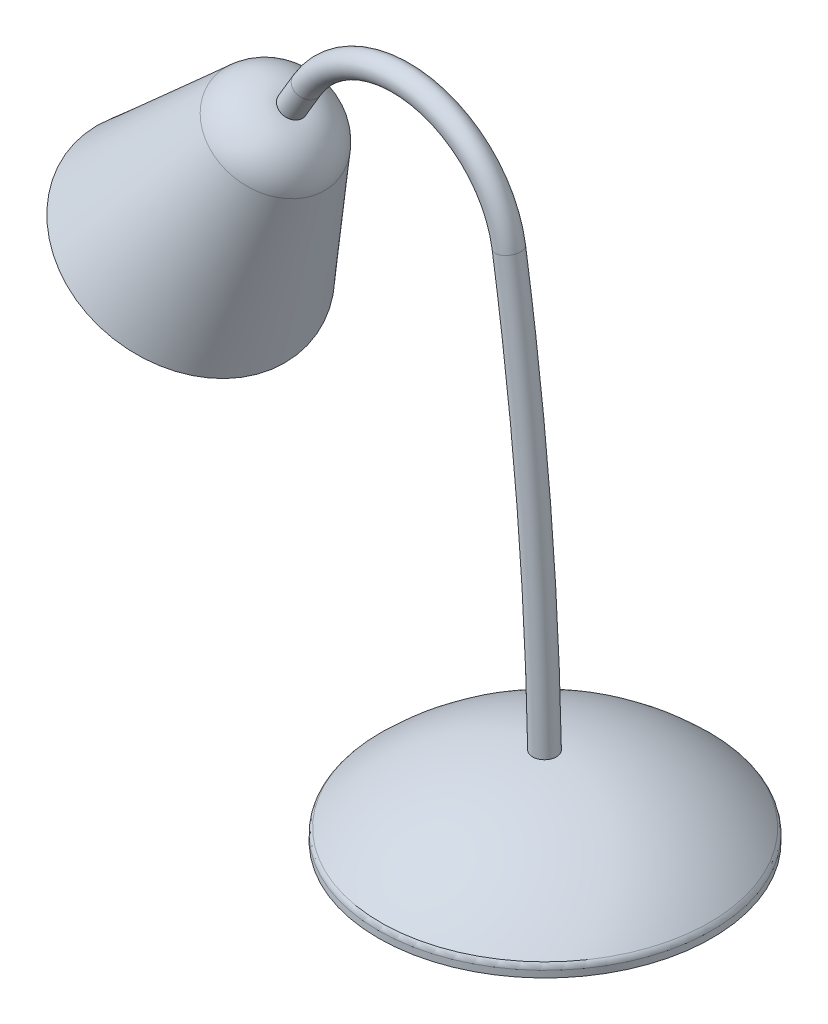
ISO-10303-21;
HEADER;
FILE_DESCRIPTION(('STEP AP214'),'2;1');
FILE_NAME('part.step','',(''),(''),'','','');
FILE_SCHEMA(('AUTOMOTIVE_DESIGN { 1 0 10303 214 1 1 1 1 }'));
ENDSEC;
DATA;
#1=APPLICATION_CONTEXT('core data for automotive mechanical design processes');
#2=APPLICATION_PROTOCOL_DEFINITION('international standard','automotive_design',2000,#1);
#3=PRODUCT_CONTEXT('',#1,'mechanical');
#4=PRODUCT('Part','Part','',(#3));
#5=PRODUCT_RELATED_PRODUCT_CATEGORY('part','',(#4));
#6=PRODUCT_DEFINITION_FORMATION('','',#4);
#7=PRODUCT_DEFINITION_CONTEXT('part definition',#1,'design');
#8=PRODUCT_DEFINITION('design','',#6,#7);
#9=PRODUCT_DEFINITION_SHAPE('','',#8);
#10=(LENGTH_UNIT() NAMED_UNIT(*) SI_UNIT(.MILLI.,.METRE.));
#11=(NAMED_UNIT(*) PLANE_ANGLE_UNIT() SI_UNIT($,.RADIAN.));
#12=(NAMED_UNIT(*) SI_UNIT($,.STERADIAN.) SOLID_ANGLE_UNIT());
#13=UNCERTAINTY_MEASURE_WITH_UNIT(LENGTH_MEASURE(1.E-05),#10,'distance_accuracy_value','');
#14=(GEOMETRIC_REPRESENTATION_CONTEXT(3) GLOBAL_UNCERTAINTY_ASSIGNED_CONTEXT((#13)) GLOBAL_UNIT_ASSIGNED_CONTEXT((#10,
#11,#12)) REPRESENTATION_CONTEXT('',''));
#15=CARTESIAN_POINT('',(0.,0.,0.));
#16=DIRECTION('',(0.,0.,1.));
#17=DIRECTION('',(1.,0.,0.));
#18=AXIS2_PLACEMENT_3D('',#15,#16,#17);
#19=CARTESIAN_POINT('',(-286.53142494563,272.330848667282,0.));
#20=DIRECTION('',(-0.510660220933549,-0.859782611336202,0.));
#21=DIRECTION('',(0.859782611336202,-0.510660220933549,0.));
#22=AXIS2_PLACEMENT_3D('',#19,#20,#21);
#23=PLANE('',#22);
#24=CARTESIAN_POINT('',(-226.475609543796,236.661232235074,0.));
#25=DIRECTION('',(0.510660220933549,0.859782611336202,0.));
#26=DIRECTION('',(-0.859782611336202,0.510660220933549,0.));
#27=AXIS2_PLACEMENT_3D('',#24,#25,#26);
#28=CIRCLE('',#27,69.85);
#29=CARTESIAN_POINT('',(-286.53142494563,272.330848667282,0.));
#30=VERTEX_POINT('',#29);
#31=EDGE_CURVE('E102',#30,#30,#28,.T.);
#32=ORIENTED_EDGE('',*,*,#31,.F.);
#33=EDGE_LOOP('',(#32));
#34=FACE_BOUND('',#33,.T.);
#35=CARTESIAN_POINT('',(-226.475609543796,236.661232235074,0.));
#36=DIRECTION('',(-0.510660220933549,-0.859782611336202,0.));
#37=DIRECTION('',(0.859782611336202,-0.510660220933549,0.));
#38=AXIS2_PLACEMENT_3D('',#35,#36,#37);
#39=CIRCLE('',#38,67.1867731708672);
#40=CARTESIAN_POINT('',(-168.709590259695,202.351619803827,0.));
#41=VERTEX_POINT('',#40);
#42=EDGE_CURVE('E88',#41,#41,#39,.F.);
#43=ORIENTED_EDGE('',*,*,#42,.T.);
#44=EDGE_LOOP('',(#43));
#45=FACE_BOUND('',#44,.T.);
#46=ADVANCED_FACE('F34',(#34,#45),#23,.T.);
#47=CARTESIAN_POINT('',(0.,-80.427776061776,0.));
#48=DIRECTION('',(0.,-1.,0.));
#49=DIRECTION('',(-1.,0.,0.));
#50=AXIS2_PLACEMENT_3D('',#47,#48,#49);
#51=SPHERICAL_SURFACE('',#50,150.241);
#52=CARTESIAN_POINT('',(0.,26.8786413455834,0.));
#53=DIRECTION('',(0.,-1.,0.));
#54=DIRECTION('',(0.,0.,-1.));
#55=AXIS2_PLACEMENT_3D('',#52,#53,#54);
#56=CIRCLE('',#55,105.155555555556);
#57=CARTESIAN_POINT('',(0.,26.8786413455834,-105.155555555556));
#58=VERTEX_POINT('',#57);
#59=EDGE_CURVE('E11',#58,#58,#56,.F.);
#60=ORIENTED_EDGE('',*,*,#59,.T.);
#61=EDGE_LOOP('',(#60));
#62=FACE_BOUND('',#61,.T.);
#63=CARTESIAN_POINT('',(-7.36801113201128,69.6017666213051,-3.03427343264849));
#64=CARTESIAN_POINT('',(-7.45326090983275,69.6015511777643,-2.83792109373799));
#65=CARTESIAN_POINT('',(-7.53021992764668,69.6013566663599,-2.63799675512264));
#66=CARTESIAN_POINT('',(-7.66705941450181,69.6010107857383,-2.23231376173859));
#67=CARTESIAN_POINT('',(-7.72693538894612,69.6008594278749,-2.02655358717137));
#68=CARTESIAN_POINT('',(-7.82919325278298,69.6006009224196,-1.61054016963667));
#69=CARTESIAN_POINT('',(-7.87155951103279,69.6004938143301,-1.40028308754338));
#70=CARTESIAN_POINT('',(-7.93843388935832,69.6003247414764,-0.976868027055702));
#71=CARTESIAN_POINT('',(-7.96293547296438,69.6002627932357,-0.763709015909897));
#72=CARTESIAN_POINT('',(-7.99386966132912,69.6001845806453,-0.336227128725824));
#73=CARTESIAN_POINT('',(-8.00031430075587,69.6001682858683,-0.12190512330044));
#74=CARTESIAN_POINT('',(-7.99512326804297,69.6001814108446,0.306523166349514));
#75=CARTESIAN_POINT('',(-7.98348732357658,69.6002108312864,0.520629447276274));
#76=CARTESIAN_POINT('',(-7.94222292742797,69.6003151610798,0.947043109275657));
#77=CARTESIAN_POINT('',(-7.91259929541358,69.6003900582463,1.1593509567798));
#78=CARTESIAN_POINT('',(-7.83557348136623,69.6005847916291,1.58072182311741));
#79=CARTESIAN_POINT('',(-7.78817088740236,69.6007046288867,1.78978476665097));
#80=CARTESIAN_POINT('',(-7.67592971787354,69.6009883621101,2.20315534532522));
#81=CARTESIAN_POINT('',(-7.61109278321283,69.6011522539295,2.40746342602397));
#82=CARTESIAN_POINT('',(-7.46441659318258,69.6015229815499,2.8099626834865));
#83=CARTESIAN_POINT('',(-7.3825714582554,69.6017298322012,3.00815171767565));
#84=CARTESIAN_POINT('',(-7.20248769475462,69.6021849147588,3.39690216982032));
#85=CARTESIAN_POINT('',(-7.10425138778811,69.6024331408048,3.58746466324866));
#86=CARTESIAN_POINT('',(-6.89207426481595,69.6029692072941,3.95964033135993));
#87=CARTESIAN_POINT('',(-6.7781332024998,69.6032570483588,4.14125336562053));
#88=CARTESIAN_POINT('',(-6.53535459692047,69.6038702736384,4.4942414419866));
#89=CARTESIAN_POINT('',(-6.40651661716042,69.6041956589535,4.66561618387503));
#90=CARTESIAN_POINT('',(-6.134860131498,69.604881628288,4.99690780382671));
#91=CARTESIAN_POINT('',(-5.99204131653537,69.6052422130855,5.15682442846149));
#92=CARTESIAN_POINT('',(-5.69346895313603,69.6059959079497,5.46403082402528));
#93=CARTESIAN_POINT('',(-5.53771781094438,69.6063890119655,5.61132293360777));
#94=CARTESIAN_POINT('',(-5.21430880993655,69.6072051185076,5.89231622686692));
#95=CARTESIAN_POINT('',(-5.04664684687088,69.6076281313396,6.02601268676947));
#96=CARTESIAN_POINT('',(-4.70066532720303,69.6085008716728,6.27880000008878));
#97=CARTESIAN_POINT('',(-4.52234632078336,69.6089505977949,6.39789160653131));
#98=CARTESIAN_POINT('',(-4.15630779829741,69.6098735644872,6.62063301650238));
#99=CARTESIAN_POINT('',(-3.96858813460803,69.6103468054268,6.72428257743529));
#100=CARTESIAN_POINT('',(-3.58508928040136,69.6113133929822,6.91539948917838));
#101=CARTESIAN_POINT('',(-3.38931025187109,69.6118067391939,7.00286716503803));
#102=CARTESIAN_POINT('',(-2.99107630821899,69.6128100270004,7.16100343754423));
#103=CARTESIAN_POINT('',(-2.78862124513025,69.6133199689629,7.23167166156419));
#104=CARTESIAN_POINT('',(-2.37848904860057,69.6143527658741,7.35570143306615));
#105=CARTESIAN_POINT('',(-2.1708121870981,69.6148756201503,7.40906387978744));
#106=CARTESIAN_POINT('',(-1.75162942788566,69.6159307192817,7.49812365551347));
#107=CARTESIAN_POINT('',(-1.54012222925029,69.6164629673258,7.53381486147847));
#108=CARTESIAN_POINT('',(-1.11489103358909,69.6175327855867,7.58724608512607));
#109=CARTESIAN_POINT('',(-0.901167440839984,69.6180703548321,7.60498932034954));
#110=CARTESIAN_POINT('',(-0.472981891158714,69.6191470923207,7.62240996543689));
#111=CARTESIAN_POINT('',(-0.258519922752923,69.6196862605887,7.62208709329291));
#112=CARTESIAN_POINT('',(0.16962725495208,69.6207623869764,7.60337655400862));
#113=CARTESIAN_POINT('',(0.383312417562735,69.6212993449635,7.5849878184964));
#114=CARTESIAN_POINT('',(0.808378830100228,69.6223672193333,7.53027396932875));
#115=CARTESIAN_POINT('',(1.01976002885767,69.6228981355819,7.49394845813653));
#116=CARTESIAN_POINT('',(1.43867211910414,69.623950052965,7.40362726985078));
#117=CARTESIAN_POINT('',(1.64620371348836,69.62447105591,7.3496348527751));
#118=CARTESIAN_POINT('',(2.05605268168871,69.6254997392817,7.2243397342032));
#119=CARTESIAN_POINT('',(2.25836822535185,69.6260074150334,7.15303104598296));
#120=CARTESIAN_POINT('',(2.65623347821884,69.6270055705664,6.99363507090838));
#121=CARTESIAN_POINT('',(2.85178446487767,69.6274960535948,6.90555097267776));
#122=CARTESIAN_POINT('',(3.23477340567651,69.6284564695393,6.71321975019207));
#123=CARTESIAN_POINT('',(3.42221123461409,69.6289264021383,6.60897237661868));
#124=CARTESIAN_POINT('',(3.78763409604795,69.6298423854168,6.38505850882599));
#125=CARTESIAN_POINT('',(3.96561930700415,69.6302884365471,6.26539230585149));
#126=CARTESIAN_POINT('',(4.31087862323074,69.631153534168,6.01148685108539));
#127=CARTESIAN_POINT('',(4.47815249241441,69.6315725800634,5.87724727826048));
#128=CARTESIAN_POINT('',(4.8007497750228,69.6323805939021,5.59519085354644));
#129=CARTESIAN_POINT('',(4.95607650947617,69.6327695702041,5.44737780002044));
#130=CARTESIAN_POINT('',(5.25377903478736,69.6335149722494,5.13913862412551));
#131=CARTESIAN_POINT('',(5.39615026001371,69.6338713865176,4.97870809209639));
#132=CARTESIAN_POINT('',(5.66681246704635,69.634548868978,4.64648714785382));
#133=CARTESIAN_POINT('',(5.79510909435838,69.6348699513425,4.47470133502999));
#134=CARTESIAN_POINT('',(6.0368303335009,69.635474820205,4.1208525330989));
#135=CARTESIAN_POINT('',(6.15024817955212,69.635758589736,3.93878492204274));
#136=CARTESIAN_POINT('',(6.36132172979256,69.6362866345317,3.56576387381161));
#137=CARTESIAN_POINT('',(6.45897955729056,69.6365309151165,3.37481163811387));
#138=CARTESIAN_POINT('',(6.63781583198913,69.6369782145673,2.98544510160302));
#139=CARTESIAN_POINT('',(6.71900172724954,69.637181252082,2.78703422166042));
#140=CARTESIAN_POINT('',(6.86440137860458,69.6375448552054,2.38399792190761));
#141=CARTESIAN_POINT('',(6.92860830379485,69.6377054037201,2.17937003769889));
#142=CARTESIAN_POINT('',(7.03953049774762,69.6379827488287,1.76550420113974));
#143=CARTESIAN_POINT('',(7.08625189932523,69.6380995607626,1.55626789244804));
#144=CARTESIAN_POINT('',(7.16190500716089,69.6382887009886,1.13458872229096));
#145=CARTESIAN_POINT('',(7.19083549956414,69.6383610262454,0.922145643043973));
#146=CARTESIAN_POINT('',(7.2306954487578,69.6384606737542,0.49558216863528));
#147=CARTESIAN_POINT('',(7.24162530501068,69.6384879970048,0.28146181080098));
#148=CARTESIAN_POINT('',(7.24540748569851,69.638497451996,-0.146942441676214));
#149=CARTESIAN_POINT('',(7.23825947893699,69.6384795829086,-0.361226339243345));
#150=CARTESIAN_POINT('',(7.20593635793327,69.6383987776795,-0.788426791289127));
#151=CARTESIAN_POINT('',(7.1807615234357,69.6383358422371,-1.00134336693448));
#152=CARTESIAN_POINT('',(7.1125597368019,69.6381653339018,-1.42432632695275));
#153=CARTESIAN_POINT('',(7.069530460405,69.6380577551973,-1.63439233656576));
#154=CARTESIAN_POINT('',(6.96594380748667,69.6377987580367,-2.05007991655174));
#155=CARTESIAN_POINT('',(6.90539250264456,69.6376473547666,-2.25570299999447));
#156=CARTESIAN_POINT('',(6.76717385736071,69.6373017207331,-2.66115610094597));
#157=CARTESIAN_POINT('',(6.68950336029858,69.6371074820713,-2.86098504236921));
#158=CARTESIAN_POINT('',(6.51760723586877,69.6366775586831,-3.25338549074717));
#159=CARTESIAN_POINT('',(6.42338197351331,69.6364418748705,-3.4459571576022));
#160=CARTESIAN_POINT('',(6.21903937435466,69.6359306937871,-3.82249016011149));
#161=CARTESIAN_POINT('',(6.10892110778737,69.635655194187,-4.00645099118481));
#162=CARTESIAN_POINT('',(5.87358173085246,69.6350663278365,-4.36444008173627));
#163=CARTESIAN_POINT('',(5.74836085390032,69.6347529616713,-4.53846849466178));
#164=CARTESIAN_POINT('',(5.48368156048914,69.6340904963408,-4.87538960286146));
#165=CARTESIAN_POINT('',(5.34422058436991,69.6337413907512,-5.03828028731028));
#166=CARTESIAN_POINT('',(5.05212249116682,69.6330100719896,-5.35167951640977));
#167=CARTESIAN_POINT('',(4.89948994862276,69.6326278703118,-5.50219232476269));
#168=CARTESIAN_POINT('',(4.5820450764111,69.6318328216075,-5.78987237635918));
#169=CARTESIAN_POINT('',(4.41722915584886,69.6314199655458,-5.92703565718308));
#170=CARTESIAN_POINT('',(4.07663309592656,69.6305666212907,-6.1869887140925));
#171=CARTESIAN_POINT('',(3.90085319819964,69.6301261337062,-6.30977880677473));
#172=CARTESIAN_POINT('',(3.53957174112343,69.629220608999,-6.54011922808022));
#173=CARTESIAN_POINT('',(3.35406997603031,69.6287555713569,-6.64766923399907));
#174=CARTESIAN_POINT('',(2.97466986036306,69.6278042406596,-6.84676093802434));
#175=CARTESIAN_POINT('',(2.78077163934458,69.6273179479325,-6.93830288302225));
#176=CARTESIAN_POINT('',(2.38589180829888,69.6263273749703,-7.10475664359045));
#177=CARTESIAN_POINT('',(2.18490798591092,69.6258230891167,-7.17966321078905));
#178=CARTESIAN_POINT('',(1.77741469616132,69.6248004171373,-7.31225425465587));
#179=CARTESIAN_POINT('',(1.57090716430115,69.6242820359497,-7.36994467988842));
#180=CARTESIAN_POINT('',(1.15372817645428,69.623234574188,-7.4677378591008));
#181=CARTESIAN_POINT('',(0.943055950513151,69.6227054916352,-7.50783732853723));
#182=CARTESIAN_POINT('',(0.519087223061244,69.621640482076,-7.57014739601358));
#183=CARTESIAN_POINT('',(0.305790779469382,69.6211045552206,-7.59235838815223));
#184=CARTESIAN_POINT('',(-0.121944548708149,69.6200295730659,-7.61873707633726));
#185=CARTESIAN_POINT('',(-0.336383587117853,69.6194905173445,-7.62290227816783));
#186=CARTESIAN_POINT('',(-0.764846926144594,69.6184131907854,-7.61315306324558));
#187=CARTESIAN_POINT('',(-0.97887123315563,69.6178749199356,-7.59923892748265));
#188=CARTESIAN_POINT('',(-1.40501721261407,69.6168029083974,-7.55342709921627));
#189=CARTESIAN_POINT('',(-1.61713861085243,69.6162691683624,-7.52152685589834));
#190=CARTESIAN_POINT('',(-2.03786652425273,69.6152102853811,-7.43998177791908));
#191=CARTESIAN_POINT('',(-2.24647423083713,69.6146851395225,-7.39034309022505));
#192=CARTESIAN_POINT('',(-2.65878837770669,69.6136469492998,-7.27366586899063));
#193=CARTESIAN_POINT('',(-2.86249432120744,69.6131339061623,-7.20662557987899));
#194=CARTESIAN_POINT('',(-3.26353029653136,69.6121236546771,-7.05562548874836));
#195=CARTESIAN_POINT('',(-3.46086047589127,69.6116264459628,-6.97166607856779));
#196=CARTESIAN_POINT('',(-3.84779895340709,69.6106512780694,-6.7873984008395));
#197=CARTESIAN_POINT('',(-4.03740516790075,69.6101733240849,-6.68708575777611));
#198=CARTESIAN_POINT('',(-4.40748791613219,69.6092402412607,-6.4708423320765));
#199=CARTESIAN_POINT('',(-4.58796458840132,69.6087851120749,-6.3549117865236));
#200=CARTESIAN_POINT('',(-4.93861294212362,69.6079006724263,-6.10818098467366));
#201=CARTESIAN_POINT('',(-5.10877836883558,69.6074713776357,-5.97737183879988));
#202=CARTESIAN_POINT('',(-5.43741328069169,69.6066421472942,-5.70192280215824));
#203=CARTESIAN_POINT('',(-5.5958870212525,69.6062422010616,-5.55728798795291));
#204=CARTESIAN_POINT('',(-5.89994555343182,69.6054747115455,-5.25530701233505));
#205=CARTESIAN_POINT('',(-6.04554170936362,69.6051071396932,-5.09797229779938));
#206=CARTESIAN_POINT('',(-6.3229236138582,69.6044067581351,-4.77165500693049));
#207=CARTESIAN_POINT('',(-6.45471298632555,69.6040739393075,-4.60267550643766));
#208=CARTESIAN_POINT('',(-6.7346061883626,69.6033670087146,-4.21079164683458));
#209=CARTESIAN_POINT('',(-6.87860247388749,69.6030032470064,-3.98493614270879));
#210=CARTESIAN_POINT('',(-7.14205006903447,69.6023376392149,-3.5193368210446));
#211=CARTESIAN_POINT('',(-7.26150137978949,69.6020357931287,-3.27959300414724));
#212=CARTESIAN_POINT('',(-7.36801113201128,69.6017666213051,-3.03427343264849));
#213=B_SPLINE_CURVE_WITH_KNOTS('',3,(#63,#64,#65,#66,#67,#68,#69,#70,#71,#72,#73,#74,#75,#76,
#77,#78,#79,#80,#81,#82,#83,#84,#85,#86,#87,#88,#89,#90,#91,#92,#93,#94,#95,#96,#97,#98,#99,
#100,#101,#102,#103,#104,#105,#106,#107,#108,#109,#110,#111,#112,#113,#114,#115,#116,#117,#118,
#119,#120,#121,#122,#123,#124,#125,#126,#127,#128,#129,#130,#131,#132,#133,#134,#135,#136,#137,
#138,#139,#140,#141,#142,#143,#144,#145,#146,#147,#148,#149,#150,#151,#152,#153,#154,#155,#156,
#157,#158,#159,#160,#161,#162,#163,#164,#165,#166,#167,#168,#169,#170,#171,#172,#173,#174,#175,
#176,#177,#178,#179,#180,#181,#182,#183,#184,#185,#186,#187,#188,#189,#190,#191,#192,#193,#194,
#195,#196,#197,#198,#199,#200,#201,#202,#203,#204,#205,#206,#207,#208,#209,#210,#211,#212),
.UNSPECIFIED.,.T.,.F.,(4,2,2,2,2,2,2,2,2,2,2,2,2,2,2,2,2,2,2,2,2,2,2,2,2,2,2,2,2,2,2,2,2,2,2,2,
2,2,2,2,2,2,2,2,2,2,2,2,2,2,2,2,2,2,2,2,2,2,2,2,2,2,2,2,2,2,2,2,2,2,2,2,2,2,4),(0.,
0.641947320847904,1.28406338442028,1.92675144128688,2.56967453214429,3.21216902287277,
3.85467319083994,4.49700528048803,5.13935225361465,5.78163879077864,6.42414773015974,
7.06656574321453,7.70899383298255,8.35144075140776,8.99390187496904,9.63624372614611,
10.2788080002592,10.9213391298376,11.5638803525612,12.2064086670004,12.848951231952,
13.4914604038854,14.1341920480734,14.7768084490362,15.4194348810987,16.0620993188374,
16.7047780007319,17.3473381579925,17.9901207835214,18.6327813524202,19.2754518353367,
19.9181101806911,20.5607826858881,21.20327589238,21.8459946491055,22.4884546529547,
23.1312057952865,23.7738702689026,24.4162435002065,25.058874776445,25.7012804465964,
26.3437299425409,26.9861651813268,27.6286121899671,28.2710492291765,28.9135699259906,
29.5558682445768,30.1982850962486,30.8406877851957,31.483128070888,32.12555842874,
32.7681044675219,33.4104282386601,34.0529420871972,34.695441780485,35.3379550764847,
35.9804584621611,36.6231642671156,37.2656477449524,37.9082511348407,38.5508403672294,
39.1935184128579,39.8361864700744,40.4789456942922,41.1214823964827,41.7640839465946,
42.4066706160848,43.0494295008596,43.6921786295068,44.3353138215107,44.9782137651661,
45.6205405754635,46.2626983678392,47.0647374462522,47.8667764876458),.UNSPECIFIED.);
#214=CARTESIAN_POINT('',(-7.36801113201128,69.6017666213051,-3.03427343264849));
#215=VERTEX_POINT('',#214);
#216=EDGE_CURVE('E121',#215,#215,#213,.T.);
#217=ORIENTED_EDGE('',*,*,#216,.F.);
#218=EDGE_LOOP('',(#217));
#219=FACE_BOUND('',#218,.T.);
#220=ADVANCED_FACE('F128',(#62,#219),#51,.T.);
#221=CARTESIAN_POINT('',(0.,19.0132239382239,0.));
#222=DIRECTION('',(0.,1.,0.));
#223=DIRECTION('',(0.,0.,1.));
#224=AXIS2_PLACEMENT_3D('',#221,#222,#223);
#225=PLANE('',#224);
#226=CARTESIAN_POINT('',(0.,19.0132239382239,0.));
#227=DIRECTION('',(0.,-1.,0.));
#228=DIRECTION('',(0.,0.,-1.));
#229=AXIS2_PLACEMENT_3D('',#226,#227,#228);
#230=CIRCLE('',#229,106.68);
#231=CARTESIAN_POINT('',(0.,19.0132239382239,-106.68));
#232=VERTEX_POINT('',#231);
#233=EDGE_CURVE('E118',#232,#232,#230,.T.);
#234=ORIENTED_EDGE('',*,*,#233,.T.);
#235=EDGE_LOOP('',(#234));
#236=FACE_BOUND('',#235,.T.);
#237=ADVANCED_FACE('F36',(#236),#225,.F.);
#238=CARTESIAN_POINT('',(0.,0.,0.));
#239=DIRECTION('',(0.,-1.,0.));
#240=DIRECTION('',(0.,0.,-1.));
#241=AXIS2_PLACEMENT_3D('',#238,#239,#240);
#242=CYLINDRICAL_SURFACE('',#241,106.68);
#243=CARTESIAN_POINT('',(0.,23.2503601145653,0.));
#244=DIRECTION('',(0.,-1.,0.));
#245=DIRECTION('',(0.,0.,-1.));
#246=AXIS2_PLACEMENT_3D('',#243,#244,#245);
#247=CIRCLE('',#246,106.68);
#248=CARTESIAN_POINT('',(0.,23.2503601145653,-106.68));
#249=VERTEX_POINT('',#248);
#250=EDGE_CURVE('E42',#249,#249,#247,.T.);
#251=ORIENTED_EDGE('',*,*,#250,.T.);
#252=EDGE_LOOP('',(#251));
#253=FACE_BOUND('',#252,.T.);
#254=ORIENTED_EDGE('',*,*,#233,.F.);
#255=EDGE_LOOP('',(#254));
#256=FACE_BOUND('',#255,.T.);
#257=ADVANCED_FACE('F137',(#253,#256),#242,.T.);
#258=CARTESIAN_POINT('',(-2032.,30.4668916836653,0.));
#259=DIRECTION('',(0.,0.,1.));
#260=DIRECTION('',(1.,0.,0.));
#261=AXIS2_PLACEMENT_3D('',#258,#259,#260);
#262=TOROIDAL_SURFACE('',#261,2032.,7.62);
#263=CARTESIAN_POINT('',(-23.1991434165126,336.641872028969,0.));
#264=DIRECTION('',(0.15067666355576,-0.988583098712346,0.));
#265=DIRECTION('',(0.,0.,-1.));
#266=AXIS2_PLACEMENT_3D('',#263,#264,#265);
#267=CIRCLE('',#266,7.62);
#268=CARTESIAN_POINT('',(-15.6661402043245,337.790028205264,0.));
#269=VERTEX_POINT('',#268);
#270=EDGE_CURVE('E108',#269,#269,#267,.T.);
#271=ORIENTED_EDGE('',*,*,#270,.T.);
#272=EDGE_LOOP('',(#271));
#273=FACE_BOUND('',#272,.T.);
#274=ORIENTED_EDGE('',*,*,#216,.T.);
#275=EDGE_LOOP('',(#274));
#276=FACE_BOUND('',#275,.T.);
#277=ADVANCED_FACE('F131',(#273,#276),#262,.T.);
#278=CARTESIAN_POINT('',(-152.307488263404,361.786723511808,0.));
#279=DIRECTION('',(-0.510660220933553,-0.8597826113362,0.));
#280=DIRECTION('',(0.8597826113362,-0.510660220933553,0.));
#281=AXIS2_PLACEMENT_3D('',#278,#279,#280);
#282=CYLINDRICAL_SURFACE('',#281,7.62);
#283=CARTESIAN_POINT('',(-152.307488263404,361.786723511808,0.));
#284=DIRECTION('',(0.510660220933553,0.8597826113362,0.));
#285=DIRECTION('',(0.,0.,-1.));
#286=AXIS2_PLACEMENT_3D('',#283,#284,#285);
#287=CIRCLE('',#286,7.62);
#288=CARTESIAN_POINT('',(-158.859031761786,365.677954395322,0.));
#289=VERTEX_POINT('',#288);
#290=EDGE_CURVE('E111',#289,#289,#287,.T.);
#291=ORIENTED_EDGE('',*,*,#290,.F.);
#292=EDGE_LOOP('',(#291));
#293=FACE_BOUND('',#292,.T.);
#294=CARTESIAN_POINT('',(-161.731942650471,345.919064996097,0.));
#295=DIRECTION('',(0.510660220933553,0.8597826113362,0.));
#296=DIRECTION('',(0.,0.,-1.));
#297=AXIS2_PLACEMENT_3D('',#294,#295,#296);
#298=CIRCLE('',#297,7.62);
#299=CARTESIAN_POINT('',(-161.676852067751,345.886344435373,7.61973059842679));
#300=VERTEX_POINT('',#299);
#301=CARTESIAN_POINT('',(-161.676852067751,345.886344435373,-7.6197305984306));
#302=VERTEX_POINT('',#301);
#303=EDGE_CURVE('E115',#300,#302,#298,.T.);
#304=ORIENTED_EDGE('',*,*,#303,.T.);
#305=EDGE_CURVE('E114',#302,#300,#298,.T.);
#306=ORIENTED_EDGE('',*,*,#305,.T.);
#307=EDGE_LOOP('',(#304,#306));
#308=FACE_BOUND('',#307,.T.);
#309=ADVANCED_FACE('F136',(#293,#308),#282,.T.);
#310=CARTESIAN_POINT('',(-92.2516728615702,326.117107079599,0.));
#311=DIRECTION('',(0.,0.,1.));
#312=DIRECTION('',(1.,0.,0.));
#313=AXIS2_PLACEMENT_3D('',#310,#311,#312);
#314=TOROIDAL_SURFACE('',#313,69.8500000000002,7.62);
#315=CARTESIAN_POINT('',(-92.2516728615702,326.117107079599,0.));
#316=DIRECTION('',(0.,0.,1.));
#317=DIRECTION('',(1.,0.,0.));
#318=AXIS2_PLACEMENT_3D('',#315,#316,#317);
#319=CIRCLE('',#318,77.4700000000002);
#320=EDGE_CURVE('',#269,#289,#319,.T.);
#321=ORIENTED_EDGE('',*,*,#270,.F.);
#322=ORIENTED_EDGE('',*,*,#290,.T.);
#323=ORIENTED_EDGE('',*,*,#320,.T.);
#324=ORIENTED_EDGE('',*,*,#320,.F.);
#325=EDGE_LOOP('',(#321,#323,#322,#324));
#326=FACE_BOUND('',#325,.T.);
#327=ADVANCED_FACE('F141',(#326),#314,.T.);
#328=CARTESIAN_POINT('',(-161.731942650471,345.919064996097,0.));
#329=DIRECTION('',(0.510660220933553,0.8597826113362,0.));
#330=DIRECTION('',(0.,0.,-1.));
#331=AXIS2_PLACEMENT_3D('',#328,#329,#330);
#332=PLANE('',#331);
#333=ORIENTED_EDGE('',*,*,#305,.F.);
#334=CARTESIAN_POINT('',(-161.621761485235,345.853623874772,0.));
#335=DIRECTION('',(0.510660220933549,0.859782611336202,0.));
#336=DIRECTION('',(-0.859782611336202,0.510660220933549,0.));
#337=AXIS2_PLACEMENT_3D('',#334,#335,#336);
#338=CIRCLE('',#337,7.61999999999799);
#339=EDGE_CURVE('E52',#302,#300,#338,.T.);
#340=ORIENTED_EDGE('',*,*,#339,.T.);
#341=EDGE_LOOP('',(#333,#340));
#342=FACE_BOUND('',#341,.T.);
#343=ADVANCED_FACE('F139',(#342),#332,.F.);
#344=CARTESIAN_POINT('',(-161.621761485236,345.853623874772,0.));
#345=DIRECTION('',(0.510660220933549,0.859782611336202,0.));
#346=DIRECTION('',(-0.859782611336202,0.510660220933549,0.));
#347=AXIS2_PLACEMENT_3D('',#344,#345,#346);
#348=PLANE('',#347);
#349=ORIENTED_EDGE('',*,*,#303,.F.);
#350=CARTESIAN_POINT('',(-161.621761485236,345.853623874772,0.));
#351=DIRECTION('',(0.510660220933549,0.859782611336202,0.));
#352=DIRECTION('',(-0.859782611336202,0.510660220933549,0.));
#353=AXIS2_PLACEMENT_3D('',#350,#351,#352);
#354=CIRCLE('',#353,7.6200000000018);
#355=EDGE_CURVE('E48',#300,#302,#354,.T.);
#356=ORIENTED_EDGE('',*,*,#355,.T.);
#357=EDGE_LOOP('',(#349,#356));
#358=FACE_BOUND('',#357,.T.);
#359=ADVANCED_FACE('F159',(#358),#348,.T.);
#360=CARTESIAN_POINT('',(-177.07757944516,319.831147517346,0.));
#361=DIRECTION('',(0.510660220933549,0.859782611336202,0.));
#362=DIRECTION('',(-0.859782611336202,0.510660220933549,0.));
#363=AXIS2_PLACEMENT_3D('',#360,#361,#362);
#364=DEGENERATE_TOROIDAL_SURFACE('',#363,7.61999999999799,30.266344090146,.T.);
#365=CARTESIAN_POINT('',(-172.430577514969,327.655159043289,0.));
#366=DIRECTION('',(0.510660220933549,0.859782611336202,0.));
#367=DIRECTION('',(-0.859782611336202,0.510660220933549,0.));
#368=AXIS2_PLACEMENT_3D('',#365,#366,#367);
#369=CIRCLE('',#368,36.4859280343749);
#370=CARTESIAN_POINT('',(-203.800543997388,346.287071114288,0.));
#371=VERTEX_POINT('',#370);
#372=EDGE_CURVE('E105',#371,#371,#369,.T.);
#373=ORIENTED_EDGE('',*,*,#372,.T.);
#374=EDGE_LOOP('',(#373));
#375=FACE_BOUND('',#374,.T.);
#376=ORIENTED_EDGE('',*,*,#355,.F.);
#377=ORIENTED_EDGE('',*,*,#339,.F.);
#378=EDGE_LOOP('',(#376,#377));
#379=FACE_BOUND('',#378,.T.);
#380=ADVANCED_FACE('F164',(#375,#379),#364,.T.);
#381=CARTESIAN_POINT('',(-172.430577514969,327.655159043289,0.));
#382=DIRECTION('',(-0.510660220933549,-0.859782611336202,0.));
#383=DIRECTION('',(0.859782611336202,-0.510660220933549,0.));
#384=AXIS2_PLACEMENT_3D('',#381,#382,#383);
#385=CONICAL_SURFACE('',#384,36.4859280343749,0.305388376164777);
#386=ORIENTED_EDGE('',*,*,#31,.T.);
#387=EDGE_LOOP('',(#386));
#388=FACE_BOUND('',#387,.T.);
#389=ORIENTED_EDGE('',*,*,#372,.F.);
#390=EDGE_LOOP('',(#389));
#391=FACE_BOUND('',#390,.T.);
#392=ADVANCED_FACE('F161',(#388,#391),#385,.T.);
#393=CARTESIAN_POINT('',(0.,-80.427776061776,0.));
#394=DIRECTION('',(0.,-1.,0.));
#395=DIRECTION('',(-1.,0.,0.));
#396=AXIS2_PLACEMENT_3D('',#393,#394,#395);
#397=SPHERICAL_SURFACE('',#396,147.701);
#398=CARTESIAN_POINT('',(0.,24.3121198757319,0.));
#399=DIRECTION('',(0.,-1.,0.));
#400=DIRECTION('',(0.,0.,-1.));
#401=AXIS2_PLACEMENT_3D('',#398,#399,#400);
#402=CIRCLE('',#401,104.14);
#403=CARTESIAN_POINT('',(0.,24.3121198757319,-104.14));
#404=VERTEX_POINT('',#403);
#405=EDGE_CURVE('E74',#404,#404,#402,.T.);
#406=ORIENTED_EDGE('',*,*,#405,.T.);
#407=EDGE_LOOP('',(#406));
#408=FACE_BOUND('',#407,.T.);
#409=CARTESIAN_POINT('',(4.08376384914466,67.1953730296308,2.51279250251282));
#410=CARTESIAN_POINT('',(4.15436241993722,67.1955311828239,2.38876723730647));
#411=CARTESIAN_POINT('',(4.21972223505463,67.1956775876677,2.26177933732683));
#412=CARTESIAN_POINT('',(4.33954090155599,67.1959459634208,2.00271063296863));
#413=CARTESIAN_POINT('',(4.39399688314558,67.1960679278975,1.87062849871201));
#414=CARTESIAN_POINT('',(4.49163615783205,67.1962865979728,1.6022304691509));
#415=CARTESIAN_POINT('',(4.53480936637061,67.1963832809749,1.46591090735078));
#416=CARTESIAN_POINT('',(4.60952746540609,67.1965506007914,1.19006715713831));
#417=CARTESIAN_POINT('',(4.64106809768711,67.1966212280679,1.05054181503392));
#418=CARTESIAN_POINT('',(4.69225204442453,67.196735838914,0.769447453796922));
#419=CARTESIAN_POINT('',(4.71190535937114,67.1967798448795,0.627880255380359));
#420=CARTESIAN_POINT('',(4.73922162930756,67.1968410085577,0.343540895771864));
#421=CARTESIAN_POINT('',(4.74688016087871,67.1968581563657,0.200768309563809));
#422=CARTESIAN_POINT('',(4.75013740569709,67.1968654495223,-0.0848260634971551));
#423=CARTESIAN_POINT('',(4.74574356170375,67.1968556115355,-0.227647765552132));
#424=CARTESIAN_POINT('',(4.72493936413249,67.1968090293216,-0.512466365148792));
#425=CARTESIAN_POINT('',(4.70852457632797,67.1967722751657,-0.65446293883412));
#426=CARTESIAN_POINT('',(4.66379687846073,67.1966721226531,-0.93652658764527));
#427=CARTESIAN_POINT('',(4.63548748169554,67.1966087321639,-1.07659421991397));
#428=CARTESIAN_POINT('',(4.56715968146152,67.1964557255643,-1.35389874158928));
#429=CARTESIAN_POINT('',(4.52713695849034,67.1963660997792,-1.49113456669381));
#430=CARTESIAN_POINT('',(4.43568636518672,67.1961612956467,-1.76170152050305));
#431=CARTESIAN_POINT('',(4.38426226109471,67.1960461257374,-1.89503392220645));
#432=CARTESIAN_POINT('',(4.27034616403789,67.1957909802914,-2.15694215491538));
#433=CARTESIAN_POINT('',(4.20785009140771,67.1956509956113,-2.28551621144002));
#434=CARTESIAN_POINT('',(4.07227080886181,67.1953472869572,-2.53689762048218));
#435=CARTESIAN_POINT('',(3.99919134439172,67.1951835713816,-2.65970699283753));
#436=CARTESIAN_POINT('',(3.84292258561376,67.1948334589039,-2.89877734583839));
#437=CARTESIAN_POINT('',(3.75972956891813,67.1946470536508,-3.01503589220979));
#438=CARTESIAN_POINT('',(3.58386809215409,67.194252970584,-3.24009427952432));
#439=CARTESIAN_POINT('',(3.49120315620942,67.1940453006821,-3.34889686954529));
#440=CARTESIAN_POINT('',(3.29703819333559,67.1936101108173,-3.5583303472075));
#441=CARTESIAN_POINT('',(3.19553491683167,67.1933825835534,-3.65895820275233));
#442=CARTESIAN_POINT('',(2.8788628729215,67.1926726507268,-3.94740406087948));
#443=CARTESIAN_POINT('',(2.65135868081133,67.1921625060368,-4.12200560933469));
#444=CARTESIAN_POINT('',(2.17038919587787,67.1910836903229,-4.43043954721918));
#445=CARTESIAN_POINT('',(1.91692393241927,67.1905150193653,-4.56427198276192));
#446=CARTESIAN_POINT('',(1.39106111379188,67.1893348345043,-4.78753309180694));
#447=CARTESIAN_POINT('',(1.11866125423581,67.1887233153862,-4.87695634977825));
#448=CARTESIAN_POINT('',(0.562723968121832,67.1874748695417,-5.0087989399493));
#449=CARTESIAN_POINT('',(0.279186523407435,67.186837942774,-5.05121819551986));
#450=CARTESIAN_POINT('',(-0.291013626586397,67.1855566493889,-5.08786175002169));
#451=CARTESIAN_POINT('',(-0.577676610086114,67.1849122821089,-5.08208172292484));
#452=CARTESIAN_POINT('',(-1.14596297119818,67.1836344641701,-5.0224775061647));
#453=CARTESIAN_POINT('',(-1.42758634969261,67.1830010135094,-4.96865332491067));
#454=CARTESIAN_POINT('',(-1.97780513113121,67.1817630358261,-4.81448684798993));
#455=CARTESIAN_POINT('',(-2.24640028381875,67.1811585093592,-4.71414365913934));
#456=CARTESIAN_POINT('',(-2.76293068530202,67.1799956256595,-4.46978541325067));
#457=CARTESIAN_POINT('',(-3.0108659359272,67.1794372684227,-4.32577036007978));
#458=CARTESIAN_POINT('',(-3.47902163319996,67.1783827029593,-3.99816498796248));
#459=CARTESIAN_POINT('',(-3.69924375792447,67.1778864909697,-3.81457706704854));
#460=CARTESIAN_POINT('',(-4.10573619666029,67.1769703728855,-3.41303094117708));
#461=CARTESIAN_POINT('',(-4.29200653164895,67.1765504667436,-3.19507275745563));
#462=CARTESIAN_POINT('',(-4.62528491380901,67.1757990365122,-2.73099966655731));
#463=CARTESIAN_POINT('',(-4.77229742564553,67.1754675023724,-2.48488796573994));
#464=CARTESIAN_POINT('',(-5.02291167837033,67.1749022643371,-1.9714741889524));
#465=CARTESIAN_POINT('',(-5.1265134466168,67.1746685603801,-1.70417212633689));
#466=CARTESIAN_POINT('',(-5.28735312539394,67.1743057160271,-1.15599919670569));
#467=CARTESIAN_POINT('',(-5.34459646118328,67.1741765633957,-0.875129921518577));
#468=CARTESIAN_POINT('',(-5.41111315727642,67.1740264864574,-0.307767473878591));
#469=CARTESIAN_POINT('',(-5.42038654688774,67.1740055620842,-0.0212743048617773));
#470=CARTESIAN_POINT('',(-5.39070121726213,67.1740725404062,0.549182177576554));
#471=CARTESIAN_POINT('',(-5.35174582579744,67.1741604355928,0.833145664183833));
#472=CARTESIAN_POINT('',(-5.22671430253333,67.1744425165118,1.390502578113));
#473=CARTESIAN_POINT('',(-5.14063815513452,67.1746367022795,1.66389600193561));
#474=CARTESIAN_POINT('',(-4.9238125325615,67.1751257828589,2.19235387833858));
#475=CARTESIAN_POINT('',(-4.79306260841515,67.1754206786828,2.44741814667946));
#476=CARTESIAN_POINT('',(-4.49059013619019,67.1761027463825,2.9319816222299));
#477=CARTESIAN_POINT('',(-4.31886761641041,67.1764899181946,3.16148084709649));
#478=CARTESIAN_POINT('',(-3.93935857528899,67.1773453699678,3.5883997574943));
#479=CARTESIAN_POINT('',(-3.73156903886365,67.1778136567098,3.78581675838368));
#480=CARTESIAN_POINT('',(-3.28565310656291,67.1788183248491,4.14302637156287));
#481=CARTESIAN_POINT('',(-3.04752663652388,67.179354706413,4.30281889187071));
#482=CARTESIAN_POINT('',(-2.6730136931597,67.1801980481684,4.51075191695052));
#483=CARTESIAN_POINT('',(-2.54520751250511,67.1804858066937,4.57479897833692));
#484=CARTESIAN_POINT('',(-2.28466957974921,67.1810723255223,4.69189965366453));
#485=CARTESIAN_POINT('',(-2.15193966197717,67.1813710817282,4.7449573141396));
#486=CARTESIAN_POINT('',(-1.88244145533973,67.1819775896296,4.83971725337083));
#487=CARTESIAN_POINT('',(-1.74567168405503,67.1822853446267,4.8814153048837));
#488=CARTESIAN_POINT('',(-1.46915425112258,67.1829074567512,4.95312912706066));
#489=CARTESIAN_POINT('',(-1.32940770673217,67.1832218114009,4.98314920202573));
#490=CARTESIAN_POINT('',(-1.04781401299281,67.1838551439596,5.03132535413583));
#491=CARTESIAN_POINT('',(-0.905965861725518,67.1841741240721,5.04947557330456));
#492=CARTESIAN_POINT('',(-0.621297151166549,67.18481416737,5.07375555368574));
#493=CARTESIAN_POINT('',(-0.478476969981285,67.1851352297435,5.07988974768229));
#494=CARTESIAN_POINT('',(-0.192780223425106,67.1857773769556,5.08010734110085));
#495=CARTESIAN_POINT('',(-0.0499036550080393,67.1860984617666,5.07418676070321));
#496=CARTESIAN_POINT('',(0.234790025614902,67.1867381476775,5.05033333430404));
#497=CARTESIAN_POINT('',(0.376607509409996,67.1870567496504,5.03240492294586));
#498=CARTESIAN_POINT('',(0.658272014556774,67.1876894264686,4.98466022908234));
#499=CARTESIAN_POINT('',(0.798118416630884,67.1880034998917,4.95484029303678));
#500=CARTESIAN_POINT('',(1.07475059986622,67.1886246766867,4.88353766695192));
#501=CARTESIAN_POINT('',(1.21153749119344,67.1889317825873,4.84205928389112));
#502=CARTESIAN_POINT('',(1.48121545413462,67.1895371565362,4.74770050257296));
#503=CARTESIAN_POINT('',(1.61410406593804,67.1898354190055,4.69481307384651));
#504=CARTESIAN_POINT('',(1.87490336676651,67.1904206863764,4.57804897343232));
#505=CARTESIAN_POINT('',(2.0028158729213,67.1907076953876,4.51417636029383));
#506=CARTESIAN_POINT('',(2.25290650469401,67.191268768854,4.37582613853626));
#507=CARTESIAN_POINT('',(2.37507991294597,67.1915428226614,4.30134000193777));
#508=CARTESIAN_POINT('',(2.61266755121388,67.1920756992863,4.14236154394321));
#509=CARTESIAN_POINT('',(2.72808423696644,67.1923345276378,4.05787289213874));
#510=CARTESIAN_POINT('',(2.95128747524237,67.1928350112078,3.87954570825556));
#511=CARTESIAN_POINT('',(3.05908073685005,67.1930766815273,3.78571557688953));
#512=CARTESIAN_POINT('',(3.26635011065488,67.1935413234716,3.58934417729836));
#513=CARTESIAN_POINT('',(3.36582840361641,67.1937642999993,3.48680520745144));
#514=CARTESIAN_POINT('',(3.57947465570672,67.1942431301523,3.24715129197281));
#515=CARTESIAN_POINT('',(3.69113142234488,67.1944933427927,3.10778499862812));
#516=CARTESIAN_POINT('',(3.89917269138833,67.194959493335,2.81808489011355));
#517=CARTESIAN_POINT('',(3.99555719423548,67.195175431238,2.66775107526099));
#518=CARTESIAN_POINT('',(4.08376384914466,67.1953730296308,2.51279250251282));
#519=B_SPLINE_CURVE_WITH_KNOTS('',3,(#409,#410,#411,#412,#413,#414,#415,#416,#417,#418,#419,
#420,#421,#422,#423,#424,#425,#426,#427,#428,#429,#430,#431,#432,#433,#434,#435,#436,#437,#438,
#439,#440,#441,#442,#443,#444,#445,#446,#447,#448,#449,#450,#451,#452,#453,#454,#455,#456,#457,
#458,#459,#460,#461,#462,#463,#464,#465,#466,#467,#468,#469,#470,#471,#472,#473,#474,#475,#476,
#477,#478,#479,#480,#481,#482,#483,#484,#485,#486,#487,#488,#489,#490,#491,#492,#493,#494,#495,
#496,#497,#498,#499,#500,#501,#502,#503,#504,#505,#506,#507,#508,#509,#510,#511,#512,#513,#514,
#515,#516,#517,#518),.UNSPECIFIED.,.T.,.F.,(4,2,2,2,2,2,2,2,2,2,2,2,2,2,2,2,2,2,2,2,2,2,2,2,2,2,
2,2,2,2,2,2,2,2,2,2,2,2,2,2,2,2,2,2,2,2,2,2,2,2,2,2,2,2,4),(0.,0.427977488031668,
0.856067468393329,1.28453877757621,1.71316677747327,2.14143368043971,2.56985848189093,
2.99801877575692,3.4263370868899,3.85452897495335,4.28287896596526,4.7110876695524,
5.13945448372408,5.56767006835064,5.99604374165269,6.42425861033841,6.8526315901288,
7.708545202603,8.56445784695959,9.42047484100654,10.2764932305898,11.1325884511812,
11.9886835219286,12.8447950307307,13.7009064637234,14.5569660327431,15.4130250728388,
16.268986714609,17.1249478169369,17.9808087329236,18.8366691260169,19.6924704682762,
20.5482720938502,21.4040823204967,22.2598919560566,23.1157731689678,23.971656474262,
24.4001090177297,24.8284035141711,25.2568571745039,25.6851527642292,26.1136595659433,
26.5420082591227,26.9704983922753,27.398830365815,27.8272940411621,28.2555996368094,
28.6841699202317,29.1125822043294,29.5413406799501,29.9699423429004,30.3981619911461,
30.8262689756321,31.3609889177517,31.8957088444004),.UNSPECIFIED.);
#520=CARTESIAN_POINT('',(4.08376384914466,67.1953730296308,2.51279250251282));
#521=VERTEX_POINT('',#520);
#522=EDGE_CURVE('E69',#521,#521,#519,.T.);
#523=ORIENTED_EDGE('',*,*,#522,.T.);
#524=EDGE_LOOP('',(#523));
#525=FACE_BOUND('',#524,.T.);
#526=ADVANCED_FACE('F163',(#408,#525),#397,.F.);
#527=CARTESIAN_POINT('',(0.,21.5532239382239,0.));
#528=DIRECTION('',(0.,1.,0.));
#529=DIRECTION('',(0.,0.,1.));
#530=AXIS2_PLACEMENT_3D('',#527,#528,#529);
#531=PLANE('',#530);
#532=CARTESIAN_POINT('',(0.,21.5532239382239,0.));
#533=DIRECTION('',(0.,1.,0.));
#534=DIRECTION('',(0.,0.,1.));
#535=AXIS2_PLACEMENT_3D('',#532,#533,#534);
#536=CIRCLE('',#535,104.14);
#537=CARTESIAN_POINT('',(0.,21.5532239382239,104.14));
#538=VERTEX_POINT('',#537);
#539=EDGE_CURVE('E78',#538,#538,#536,.F.);
#540=ORIENTED_EDGE('',*,*,#539,.F.);
#541=EDGE_LOOP('',(#540));
#542=FACE_BOUND('',#541,.T.);
#543=ADVANCED_FACE('F197',(#542),#531,.T.);
#544=CARTESIAN_POINT('',(0.,0.,0.));
#545=DIRECTION('',(0.,-1.,0.));
#546=DIRECTION('',(0.,0.,-1.));
#547=AXIS2_PLACEMENT_3D('',#544,#545,#546);
#548=CYLINDRICAL_SURFACE('',#547,104.14);
#549=ORIENTED_EDGE('',*,*,#539,.T.);
#550=EDGE_LOOP('',(#549));
#551=FACE_BOUND('',#550,.T.);
#552=ORIENTED_EDGE('',*,*,#405,.F.);
#553=EDGE_LOOP('',(#552));
#554=FACE_BOUND('',#553,.T.);
#555=ADVANCED_FACE('F216',(#551,#554),#548,.F.);
#556=CARTESIAN_POINT('',(-2032.,30.4668916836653,0.));
#557=DIRECTION('',(0.,0.,1.));
#558=DIRECTION('',(1.,0.,0.));
#559=AXIS2_PLACEMENT_3D('',#556,#557,#558);
#560=TOROIDAL_SURFACE('',#559,2032.,5.08);
#561=CARTESIAN_POINT('',(-23.1991434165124,336.641872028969,0.));
#562=DIRECTION('',(0.15067666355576,-0.988583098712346,0.));
#563=DIRECTION('',(0.988583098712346,0.15067666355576,0.));
#564=AXIS2_PLACEMENT_3D('',#561,#562,#563);
#565=CIRCLE('',#564,5.08);
#566=CARTESIAN_POINT('',(-18.1771412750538,337.407309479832,0.));
#567=VERTEX_POINT('',#566);
#568=EDGE_CURVE('E81',#567,#567,#565,.T.);
#569=ORIENTED_EDGE('',*,*,#568,.F.);
#570=EDGE_LOOP('',(#569));
#571=FACE_BOUND('',#570,.T.);
#572=ORIENTED_EDGE('',*,*,#522,.F.);
#573=EDGE_LOOP('',(#572));
#574=FACE_BOUND('',#573,.T.);
#575=ADVANCED_FACE('F199',(#571,#574),#560,.F.);
#576=CARTESIAN_POINT('',(-152.307488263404,361.786723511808,0.));
#577=DIRECTION('',(-0.510660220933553,-0.8597826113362,0.));
#578=DIRECTION('',(0.8597826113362,-0.510660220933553,0.));
#579=AXIS2_PLACEMENT_3D('',#576,#577,#578);
#580=CYLINDRICAL_SURFACE('',#579,5.08);
#581=CARTESIAN_POINT('',(-152.307488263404,361.786723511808,0.));
#582=DIRECTION('',(0.510660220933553,0.8597826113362,0.));
#583=DIRECTION('',(-0.8597826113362,0.510660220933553,0.));
#584=AXIS2_PLACEMENT_3D('',#581,#582,#583);
#585=CIRCLE('',#584,5.08);
#586=CARTESIAN_POINT('',(-156.675183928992,364.38087743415,0.));
#587=VERTEX_POINT('',#586);
#588=EDGE_CURVE('E75',#587,#587,#585,.T.);
#589=ORIENTED_EDGE('',*,*,#588,.T.);
#590=EDGE_LOOP('',(#589));
#591=FACE_BOUND('',#590,.T.);
#592=CARTESIAN_POINT('',(-163.029019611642,343.735217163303,0.));
#593=DIRECTION('',(0.510660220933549,0.859782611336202,0.));
#594=DIRECTION('',(-0.859782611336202,0.510660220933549,0.));
#595=AXIS2_PLACEMENT_3D('',#592,#593,#594);
#596=CIRCLE('',#595,5.08);
#597=CARTESIAN_POINT('',(-162.918869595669,343.669794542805,-5.07838427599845));
#598=VERTEX_POINT('',#597);
#599=EDGE_CURVE('E66',#598,#598,#596,.T.);
#600=ORIENTED_EDGE('',*,*,#599,.F.);
#601=EDGE_LOOP('',(#600));
#602=FACE_BOUND('',#601,.T.);
#603=ADVANCED_FACE('F73',(#591,#602),#580,.F.);
#604=CARTESIAN_POINT('',(-92.2516728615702,326.117107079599,0.));
#605=DIRECTION('',(0.,0.,1.));
#606=DIRECTION('',(1.,0.,0.));
#607=AXIS2_PLACEMENT_3D('',#604,#605,#606);
#608=TOROIDAL_SURFACE('',#607,69.8500000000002,5.08);
#609=CARTESIAN_POINT('',(-92.2516728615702,326.117107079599,0.));
#610=DIRECTION('',(0.,0.,1.));
#611=DIRECTION('',(1.,0.,0.));
#612=AXIS2_PLACEMENT_3D('',#609,#610,#611);
#613=CIRCLE('',#612,74.9300000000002);
#614=EDGE_CURVE('',#567,#587,#613,.T.);
#615=ORIENTED_EDGE('',*,*,#568,.T.);
#616=ORIENTED_EDGE('',*,*,#588,.F.);
#617=ORIENTED_EDGE('',*,*,#614,.T.);
#618=ORIENTED_EDGE('',*,*,#614,.F.);
#619=EDGE_LOOP('',(#615,#617,#616,#618));
#620=FACE_BOUND('',#619,.T.);
#621=ADVANCED_FACE('F211',(#620),#608,.F.);
#622=CARTESIAN_POINT('',(-162.918838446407,343.669776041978,0.));
#623=DIRECTION('',(0.510660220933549,0.859782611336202,0.));
#624=DIRECTION('',(-0.859782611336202,0.510660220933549,0.));
#625=AXIS2_PLACEMENT_3D('',#622,#623,#624);
#626=PLANE('',#625);
#627=ORIENTED_EDGE('',*,*,#599,.T.);
#628=EDGE_LOOP('',(#627));
#629=FACE_BOUND('',#628,.T.);
#630=CARTESIAN_POINT('',(-162.918838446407,343.669776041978,0.));
#631=DIRECTION('',(0.510660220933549,0.859782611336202,0.));
#632=DIRECTION('',(-0.859782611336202,0.510660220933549,0.));
#633=AXIS2_PLACEMENT_3D('',#630,#631,#632);
#634=CIRCLE('',#633,7.62000000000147);
#635=CARTESIAN_POINT('',(-162.918885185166,343.669803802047,-7.61999999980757));
#636=VERTEX_POINT('',#635);
#637=EDGE_CURVE('E67',#636,#636,#634,.T.);
#638=ORIENTED_EDGE('',*,*,#637,.F.);
#639=EDGE_LOOP('',(#638));
#640=FACE_BOUND('',#639,.T.);
#641=ADVANCED_FACE('F65',(#629,#640),#626,.F.);
#642=CARTESIAN_POINT('',(-177.07757944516,319.831147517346,0.));
#643=DIRECTION('',(0.510660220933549,0.859782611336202,0.));
#644=DIRECTION('',(-0.859782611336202,0.510660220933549,0.));
#645=AXIS2_PLACEMENT_3D('',#642,#643,#644);
#646=DEGENERATE_TOROIDAL_SURFACE('',#645,7.61999999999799,27.726344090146,.T.);
#647=CARTESIAN_POINT('',(-172.820561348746,326.998555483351,0.));
#648=DIRECTION('',(0.510660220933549,0.859782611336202,0.));
#649=DIRECTION('',(-0.859782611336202,0.510660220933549,0.));
#650=AXIS2_PLACEMENT_3D('',#647,#648,#649);
#651=CIRCLE('',#650,34.0634531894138);
#652=CARTESIAN_POINT('',(-202.107726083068,344.393406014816,0.));
#653=VERTEX_POINT('',#652);
#654=EDGE_CURVE('E85',#653,#653,#651,.T.);
#655=ORIENTED_EDGE('',*,*,#654,.F.);
#656=EDGE_LOOP('',(#655));
#657=FACE_BOUND('',#656,.T.);
#658=ORIENTED_EDGE('',*,*,#637,.T.);
#659=EDGE_LOOP('',(#658));
#660=FACE_BOUND('',#659,.T.);
#661=ADVANCED_FACE('F190',(#657,#660),#646,.F.);
#662=CARTESIAN_POINT('',(-172.820561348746,326.998555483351,0.));
#663=DIRECTION('',(-0.510660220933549,-0.859782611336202,0.));
#664=DIRECTION('',(0.859782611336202,-0.510660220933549,0.));
#665=AXIS2_PLACEMENT_3D('',#662,#663,#664);
#666=CONICAL_SURFACE('',#665,34.0634531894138,0.305388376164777);
#667=ORIENTED_EDGE('',*,*,#42,.F.);
#668=EDGE_LOOP('',(#667));
#669=FACE_BOUND('',#668,.T.);
#670=ORIENTED_EDGE('',*,*,#654,.T.);
#671=EDGE_LOOP('',(#670));
#672=FACE_BOUND('',#671,.T.);
#673=ADVANCED_FACE('F185',(#669,#672),#666,.F.);
#674=CARTESIAN_POINT('',(0.,23.2503601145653,0.));
#675=DIRECTION('',(0.,-1.,0.));
#676=DIRECTION('',(0.,0.,-1.));
#677=AXIS2_PLACEMENT_3D('',#674,#675,#676);
#678=TOROIDAL_SURFACE('',#677,101.6,5.08);
#679=ORIENTED_EDGE('',*,*,#59,.F.);
#680=EDGE_LOOP('',(#679));
#681=FACE_BOUND('',#680,.T.);
#682=ORIENTED_EDGE('',*,*,#250,.F.);
#683=EDGE_LOOP('',(#682));
#684=FACE_BOUND('',#683,.T.);
#685=ADVANCED_FACE('F183',(#681,#684),#678,.T.);
#686=CLOSED_SHELL('',(#46,#220,#237,#257,#277,#309,#327,#343,#359,#380,#392,#526,#543,#555,#575,
#603,#621,#641,#661,#673,#685));
#687=MANIFOLD_SOLID_BREP('B2',#686);
#688=ADVANCED_BREP_SHAPE_REPRESENTATION('',(#18,#687),#14);
#689=SHAPE_DEFINITION_REPRESENTATION(#9,#688);
ENDSEC;
END-ISO-10303-21;
